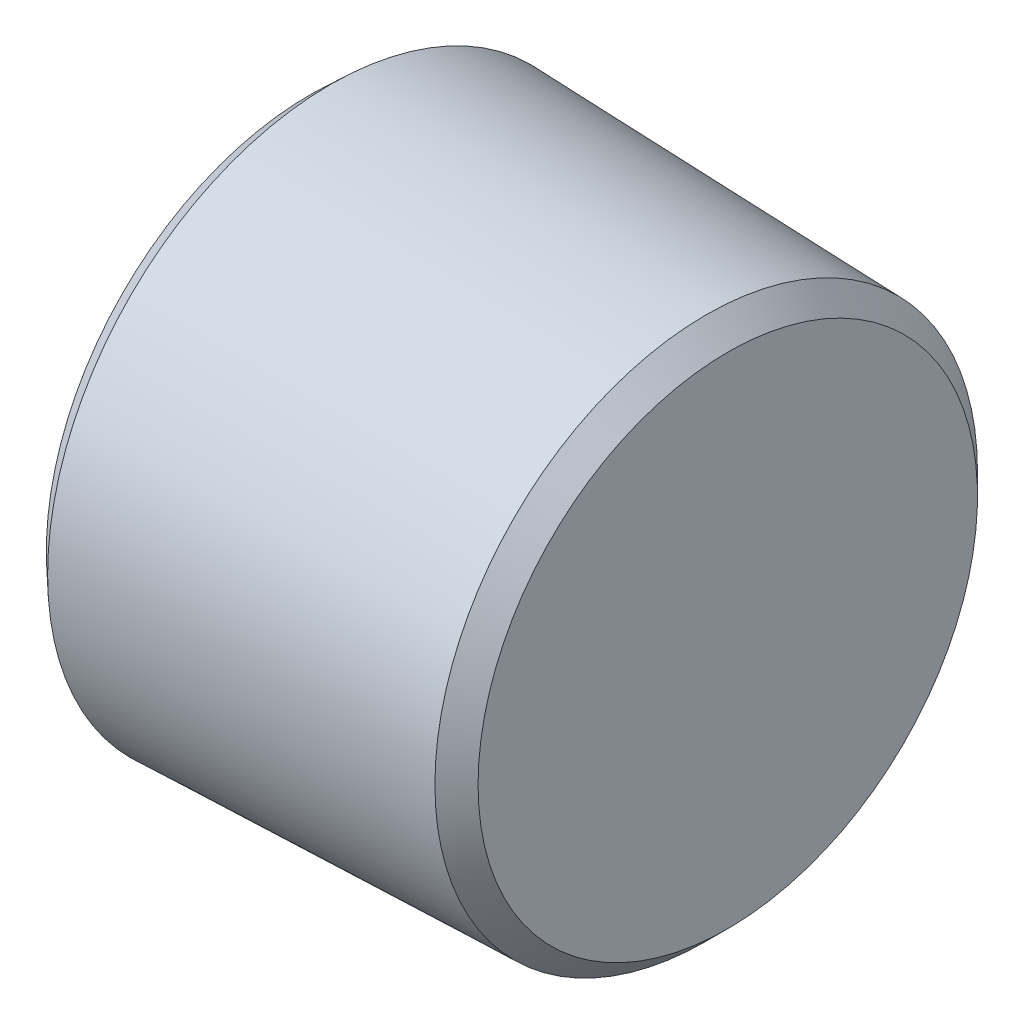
from build123d import *
from OCP.BRepFilletAPI import BRepFilletAPI_MakeChamfer

# Parameters (mm, degrees)
CUT_EXTRUDE_1_DEPTH = 3.5
CHAMFER_1_SIZE      = 0.5
CHAMFER_1_SIZE2     = 0.516380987
CHAMFER_1_SIZE2_2   = 0.48508517


with BuildPart() as part:
    # Sketch 1 → Revolve 1 (revolve)
    with BuildSketch(Plane.XY, mode=Mode.PRIVATE) as revolve_1_sk:
        Polygon((0, 0), (0, 6.786), (10, 6.4735), (10, 0), align=None)
    revolve(revolve_1_sk.sketch.rotate(Axis((0, 0, 0), (1, 0, 0)), 90), axis=Axis((0, 0, 0), (1, 0, 0)))

    # Sketch 2 → Cut-Extrude 1 (cut)
    with BuildSketch(Plane(origin=(0, 0, 0), x_dir=(0, 0, -1), z_dir=(1, 0, 0))):
        Polygon((0, 3.464101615), (-3, 1.732050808), (-3, -1.732050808), (0, -3.464101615), (3, -1.732050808), (3, 1.732050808), align=None)
    extrude(amount=CUT_EXTRUDE_1_DEPTH, mode=Mode.SUBTRACT)

    # Sketch 3 → Cut-Revolve 4 (revolve, cut)
    with BuildSketch(Plane(origin=(0, 0, 0), x_dir=(1, 0, 0), z_dir=(0, 1, 0))):
        Polygon((3.5, 0), (3.5, -3), (5.232050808, 0), align=None)
    revolve(axis=Axis((0, 0, 0), (1, 0, 0)), mode=Mode.SUBTRACT)

    # Chamfer 1: one chamfer whose edges measure the first distance from different faces: ONE call of the kernel's chamfer builder (chamfer() names one face for all edges)
    chamfer_1_edges_1 = [part.edges().sort_by_distance(p)[0] for p in [
        (10, 0, -6.4735),
    ]]
    chamfer_1_side_1 = [part.faces().sort_by_distance(p)[0] for p in [
        (10, 0, 0),
    ]]
    chamfer_1_edges_2 = [part.edges().sort_by_distance(p)[0] for p in [
        (0, 0, -6.786),
    ]]
    chamfer_1_side_2 = [part.faces().sort_by_distance(p)[0] for p in [
        (5, 0, -6.62975),
    ]]
    chamfer_1 = BRepFilletAPI_MakeChamfer(part.part.solid().wrapped)
    for e in chamfer_1_edges_1:
        chamfer_1.Add(CHAMFER_1_SIZE, CHAMFER_1_SIZE2, e.wrapped, chamfer_1_side_1[0].wrapped)  # the first distance lies on this face
    for e in chamfer_1_edges_2:
        chamfer_1.Add(CHAMFER_1_SIZE, CHAMFER_1_SIZE2_2, e.wrapped, chamfer_1_side_2[0].wrapped)  # the first distance lies on this face
    add(Compound.cast(chamfer_1.Shape()), mode=Mode.REPLACE)


solid = part.part
